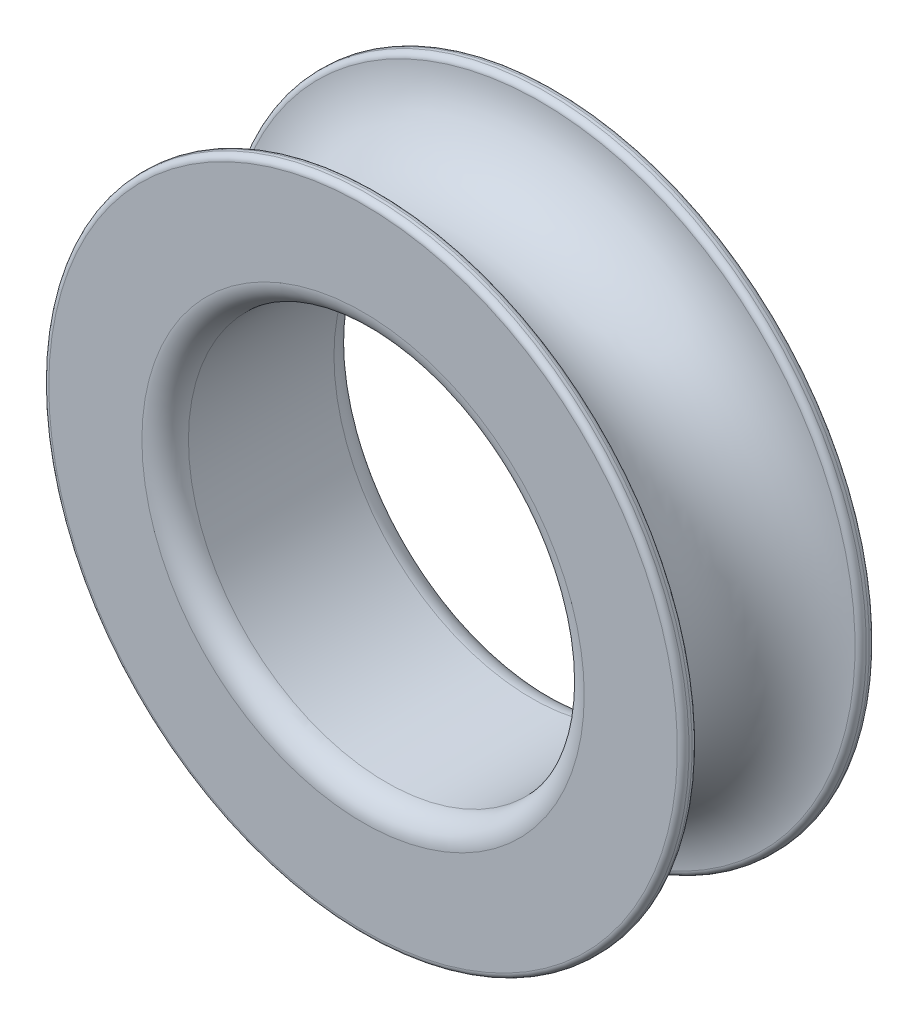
ISO-10303-21;
HEADER;
FILE_DESCRIPTION(('STEP AP214'),'2;1');
FILE_NAME('part.step','',(''),(''),'','','');
FILE_SCHEMA(('AUTOMOTIVE_DESIGN { 1 0 10303 214 1 1 1 1 }'));
ENDSEC;
DATA;
#1=APPLICATION_CONTEXT('core data for automotive mechanical design processes');
#2=APPLICATION_PROTOCOL_DEFINITION('international standard','automotive_design',2000,#1);
#3=PRODUCT_CONTEXT('',#1,'mechanical');
#4=PRODUCT('Part','Part','',(#3));
#5=PRODUCT_RELATED_PRODUCT_CATEGORY('part','',(#4));
#6=PRODUCT_DEFINITION_FORMATION('','',#4);
#7=PRODUCT_DEFINITION_CONTEXT('part definition',#1,'design');
#8=PRODUCT_DEFINITION('design','',#6,#7);
#9=PRODUCT_DEFINITION_SHAPE('','',#8);
#10=(LENGTH_UNIT() NAMED_UNIT(*) SI_UNIT(.MILLI.,.METRE.));
#11=(NAMED_UNIT(*) PLANE_ANGLE_UNIT() SI_UNIT($,.RADIAN.));
#12=(NAMED_UNIT(*) SI_UNIT($,.STERADIAN.) SOLID_ANGLE_UNIT());
#13=UNCERTAINTY_MEASURE_WITH_UNIT(LENGTH_MEASURE(1.E-05),#10,'distance_accuracy_value','');
#14=(GEOMETRIC_REPRESENTATION_CONTEXT(3) GLOBAL_UNCERTAINTY_ASSIGNED_CONTEXT((#13)) GLOBAL_UNIT_ASSIGNED_CONTEXT((#10,
#11,#12)) REPRESENTATION_CONTEXT('',''));
#15=CARTESIAN_POINT('',(0.,0.,0.));
#16=DIRECTION('',(0.,0.,1.));
#17=DIRECTION('',(1.,0.,0.));
#18=AXIS2_PLACEMENT_3D('',#15,#16,#17);
#19=CARTESIAN_POINT('',(0.,0.,-7.75000000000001));
#20=DIRECTION('',(0.,0.,-1.));
#21=DIRECTION('',(-1.,0.,0.));
#22=AXIS2_PLACEMENT_3D('',#19,#20,#21);
#23=TOROIDAL_SURFACE('',#22,27.,0.499999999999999);
#24=CARTESIAN_POINT('',(0.,0.,-7.75000000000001));
#25=DIRECTION('',(0.,0.,-1.));
#26=DIRECTION('',(-1.,0.,0.));
#27=AXIS2_PLACEMENT_3D('',#24,#25,#26);
#28=CIRCLE('',#27,27.5);
#29=CARTESIAN_POINT('',(-27.5,0.,-7.75000000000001));
#30=VERTEX_POINT('',#29);
#31=EDGE_CURVE('E10',#30,#30,#28,.T.);
#32=ORIENTED_EDGE('',*,*,#31,.T.);
#33=EDGE_LOOP('',(#32));
#34=FACE_BOUND('',#33,.T.);
#35=CARTESIAN_POINT('',(0.,0.,-8.25));
#36=DIRECTION('',(0.,0.,-1.));
#37=DIRECTION('',(-1.,0.,0.));
#38=AXIS2_PLACEMENT_3D('',#35,#36,#37);
#39=CIRCLE('',#38,27.);
#40=CARTESIAN_POINT('',(-27.,0.,-8.25000000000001));
#41=VERTEX_POINT('',#40);
#42=EDGE_CURVE('E79',#41,#41,#39,.T.);
#43=ORIENTED_EDGE('',*,*,#42,.F.);
#44=EDGE_LOOP('',(#43));
#45=FACE_BOUND('',#44,.T.);
#46=ADVANCED_FACE('F38',(#34,#45),#23,.T.);
#47=CARTESIAN_POINT('',(0.,0.,8.84));
#48=DIRECTION('',(0.,0.,-1.));
#49=DIRECTION('',(-1.,0.,0.));
#50=AXIS2_PLACEMENT_3D('',#47,#48,#49);
#51=CYLINDRICAL_SURFACE('',#50,27.5);
#52=CARTESIAN_POINT('',(0.,0.,-7.4833147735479));
#53=DIRECTION('',(0.,0.,-1.));
#54=DIRECTION('',(-1.,0.,0.));
#55=AXIS2_PLACEMENT_3D('',#52,#53,#54);
#56=CIRCLE('',#55,27.5);
#57=CARTESIAN_POINT('',(-27.5,0.,-7.4833147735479));
#58=VERTEX_POINT('',#57);
#59=EDGE_CURVE('E45',#58,#58,#56,.T.);
#60=ORIENTED_EDGE('',*,*,#59,.T.);
#61=EDGE_LOOP('',(#60));
#62=FACE_BOUND('',#61,.T.);
#63=ORIENTED_EDGE('',*,*,#31,.F.);
#64=EDGE_LOOP('',(#63));
#65=FACE_BOUND('',#64,.T.);
#66=ADVANCED_FACE('F85',(#62,#65),#51,.T.);
#67=CARTESIAN_POINT('',(0.,0.,-7.4833147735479));
#68=DIRECTION('',(0.,0.,-1.));
#69=DIRECTION('',(-1.,0.,0.));
#70=AXIS2_PLACEMENT_3D('',#67,#68,#69);
#71=TOROIDAL_SURFACE('',#70,27.,0.500000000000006);
#72=CARTESIAN_POINT('',(0.,0.,-6.98442712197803));
#73=DIRECTION('',(0.,0.,-1.));
#74=DIRECTION('',(-1.,0.,0.));
#75=AXIS2_PLACEMENT_3D('',#72,#73,#74);
#76=CIRCLE('',#75,27.0333333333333);
#77=CARTESIAN_POINT('',(-27.0333333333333,0.,-6.98442712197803));
#78=VERTEX_POINT('',#77);
#79=EDGE_CURVE('E46',#78,#78,#76,.T.);
#80=ORIENTED_EDGE('',*,*,#79,.T.);
#81=EDGE_LOOP('',(#80));
#82=FACE_BOUND('',#81,.T.);
#83=ORIENTED_EDGE('',*,*,#59,.F.);
#84=EDGE_LOOP('',(#83));
#85=FACE_BOUND('',#84,.T.);
#86=ADVANCED_FACE('F86',(#82,#85),#71,.T.);
#87=CARTESIAN_POINT('',(0.,0.,0.));
#88=DIRECTION('',(0.,0.,-1.));
#89=DIRECTION('',(-1.,0.,0.));
#90=AXIS2_PLACEMENT_3D('',#87,#88,#89);
#91=TOROIDAL_SURFACE('',#90,27.4999999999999,7.);
#92=CARTESIAN_POINT('',(0.,0.,6.98442712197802));
#93=DIRECTION('',(0.,0.,-1.));
#94=DIRECTION('',(-1.,0.,0.));
#95=AXIS2_PLACEMENT_3D('',#92,#93,#94);
#96=CIRCLE('',#95,27.0333333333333);
#97=CARTESIAN_POINT('',(-27.0333333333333,0.,6.98442712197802));
#98=VERTEX_POINT('',#97);
#99=EDGE_CURVE('E49',#98,#98,#96,.T.);
#100=ORIENTED_EDGE('',*,*,#99,.T.);
#101=EDGE_LOOP('',(#100));
#102=FACE_BOUND('',#101,.T.);
#103=ORIENTED_EDGE('',*,*,#79,.F.);
#104=EDGE_LOOP('',(#103));
#105=FACE_BOUND('',#104,.T.);
#106=ADVANCED_FACE('F95',(#102,#105),#91,.F.);
#107=CARTESIAN_POINT('',(0.,0.,7.48331477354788));
#108=DIRECTION('',(0.,0.,-1.));
#109=DIRECTION('',(-1.,0.,0.));
#110=AXIS2_PLACEMENT_3D('',#107,#108,#109);
#111=TOROIDAL_SURFACE('',#110,27.,0.499999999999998);
#112=CARTESIAN_POINT('',(0.,0.,7.48331477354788));
#113=DIRECTION('',(0.,0.,-1.));
#114=DIRECTION('',(-1.,0.,0.));
#115=AXIS2_PLACEMENT_3D('',#112,#113,#114);
#116=CIRCLE('',#115,27.5);
#117=CARTESIAN_POINT('',(-27.5,0.,7.48331477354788));
#118=VERTEX_POINT('',#117);
#119=EDGE_CURVE('E54',#118,#118,#116,.T.);
#120=ORIENTED_EDGE('',*,*,#119,.T.);
#121=EDGE_LOOP('',(#120));
#122=FACE_BOUND('',#121,.T.);
#123=ORIENTED_EDGE('',*,*,#99,.F.);
#124=EDGE_LOOP('',(#123));
#125=FACE_BOUND('',#124,.T.);
#126=ADVANCED_FACE('F97',(#122,#125),#111,.T.);
#127=CARTESIAN_POINT('',(0.,0.,8.84));
#128=DIRECTION('',(0.,0.,-1.));
#129=DIRECTION('',(-1.,0.,0.));
#130=AXIS2_PLACEMENT_3D('',#127,#128,#129);
#131=CYLINDRICAL_SURFACE('',#130,27.5);
#132=CARTESIAN_POINT('',(0.,0.,7.75));
#133=DIRECTION('',(0.,0.,-1.));
#134=DIRECTION('',(-1.,0.,0.));
#135=AXIS2_PLACEMENT_3D('',#132,#133,#134);
#136=CIRCLE('',#135,27.5);
#137=CARTESIAN_POINT('',(-27.5,0.,7.74999999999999));
#138=VERTEX_POINT('',#137);
#139=EDGE_CURVE('E59',#138,#138,#136,.T.);
#140=ORIENTED_EDGE('',*,*,#139,.T.);
#141=EDGE_LOOP('',(#140));
#142=FACE_BOUND('',#141,.T.);
#143=ORIENTED_EDGE('',*,*,#119,.F.);
#144=EDGE_LOOP('',(#143));
#145=FACE_BOUND('',#144,.T.);
#146=ADVANCED_FACE('F103',(#142,#145),#131,.T.);
#147=CARTESIAN_POINT('',(0.,0.,7.75));
#148=DIRECTION('',(0.,0.,-1.));
#149=DIRECTION('',(-1.,0.,0.));
#150=AXIS2_PLACEMENT_3D('',#147,#148,#149);
#151=TOROIDAL_SURFACE('',#150,27.,0.499999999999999);
#152=CARTESIAN_POINT('',(0.,0.,8.25));
#153=DIRECTION('',(0.,0.,-1.));
#154=DIRECTION('',(-1.,0.,0.));
#155=AXIS2_PLACEMENT_3D('',#152,#153,#154);
#156=CIRCLE('',#155,27.);
#157=CARTESIAN_POINT('',(-27.,0.,8.24999999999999));
#158=VERTEX_POINT('',#157);
#159=EDGE_CURVE('E64',#158,#158,#156,.T.);
#160=ORIENTED_EDGE('',*,*,#159,.T.);
#161=EDGE_LOOP('',(#160));
#162=FACE_BOUND('',#161,.T.);
#163=ORIENTED_EDGE('',*,*,#139,.F.);
#164=EDGE_LOOP('',(#163));
#165=FACE_BOUND('',#164,.T.);
#166=ADVANCED_FACE('F110',(#162,#165),#151,.T.);
#167=CARTESIAN_POINT('',(27.,0.,8.25));
#168=DIRECTION('',(0.,0.,1.));
#169=DIRECTION('',(1.,0.,0.));
#170=AXIS2_PLACEMENT_3D('',#167,#168,#169);
#171=PLANE('',#170);
#172=CARTESIAN_POINT('',(0.,0.,8.25));
#173=DIRECTION('',(0.,0.,-1.));
#174=DIRECTION('',(-1.,0.,0.));
#175=AXIS2_PLACEMENT_3D('',#172,#173,#174);
#176=CIRCLE('',#175,19.);
#177=CARTESIAN_POINT('',(-19.,0.,8.25));
#178=VERTEX_POINT('',#177);
#179=EDGE_CURVE('E63',#178,#178,#176,.T.);
#180=ORIENTED_EDGE('',*,*,#179,.T.);
#181=EDGE_LOOP('',(#180));
#182=FACE_BOUND('',#181,.T.);
#183=ORIENTED_EDGE('',*,*,#159,.F.);
#184=EDGE_LOOP('',(#183));
#185=FACE_BOUND('',#184,.T.);
#186=ADVANCED_FACE('F112',(#182,#185),#171,.T.);
#187=CARTESIAN_POINT('',(0.,0.,6.25));
#188=DIRECTION('',(0.,0.,-1.));
#189=DIRECTION('',(-1.,0.,0.));
#190=AXIS2_PLACEMENT_3D('',#187,#188,#189);
#191=TOROIDAL_SURFACE('',#190,19.,2.);
#192=CARTESIAN_POINT('',(0.,0.,6.25));
#193=DIRECTION('',(0.,0.,-1.));
#194=DIRECTION('',(-1.,0.,0.));
#195=AXIS2_PLACEMENT_3D('',#192,#193,#194);
#196=CIRCLE('',#195,17.);
#197=CARTESIAN_POINT('',(-17.,0.,6.25));
#198=VERTEX_POINT('',#197);
#199=EDGE_CURVE('E69',#198,#198,#196,.T.);
#200=ORIENTED_EDGE('',*,*,#199,.T.);
#201=EDGE_LOOP('',(#200));
#202=FACE_BOUND('',#201,.T.);
#203=ORIENTED_EDGE('',*,*,#179,.F.);
#204=EDGE_LOOP('',(#203));
#205=FACE_BOUND('',#204,.T.);
#206=ADVANCED_FACE('F113',(#202,#205),#191,.T.);
#207=CARTESIAN_POINT('',(0.,0.,8.84));
#208=DIRECTION('',(0.,0.,-1.));
#209=DIRECTION('',(-1.,0.,0.));
#210=AXIS2_PLACEMENT_3D('',#207,#208,#209);
#211=CYLINDRICAL_SURFACE('',#210,17.);
#212=CARTESIAN_POINT('',(0.,0.,-6.25));
#213=DIRECTION('',(0.,0.,-1.));
#214=DIRECTION('',(-1.,0.,0.));
#215=AXIS2_PLACEMENT_3D('',#212,#213,#214);
#216=CIRCLE('',#215,17.);
#217=CARTESIAN_POINT('',(-17.,0.,-6.25));
#218=VERTEX_POINT('',#217);
#219=EDGE_CURVE('E66',#218,#218,#216,.T.);
#220=ORIENTED_EDGE('',*,*,#219,.T.);
#221=EDGE_LOOP('',(#220));
#222=FACE_BOUND('',#221,.T.);
#223=ORIENTED_EDGE('',*,*,#199,.F.);
#224=EDGE_LOOP('',(#223));
#225=FACE_BOUND('',#224,.T.);
#226=ADVANCED_FACE('F118',(#222,#225),#211,.F.);
#227=CARTESIAN_POINT('',(0.,0.,-6.25));
#228=DIRECTION('',(0.,0.,-1.));
#229=DIRECTION('',(-1.,0.,0.));
#230=AXIS2_PLACEMENT_3D('',#227,#228,#229);
#231=TOROIDAL_SURFACE('',#230,19.,2.);
#232=CARTESIAN_POINT('',(0.,0.,-8.25));
#233=DIRECTION('',(0.,0.,-1.));
#234=DIRECTION('',(-1.,0.,0.));
#235=AXIS2_PLACEMENT_3D('',#232,#233,#234);
#236=CIRCLE('',#235,19.);
#237=CARTESIAN_POINT('',(-19.,0.,-8.25000000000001));
#238=VERTEX_POINT('',#237);
#239=EDGE_CURVE('E71',#238,#238,#236,.T.);
#240=ORIENTED_EDGE('',*,*,#239,.T.);
#241=EDGE_LOOP('',(#240));
#242=FACE_BOUND('',#241,.T.);
#243=ORIENTED_EDGE('',*,*,#219,.F.);
#244=EDGE_LOOP('',(#243));
#245=FACE_BOUND('',#244,.T.);
#246=ADVANCED_FACE('F122',(#242,#245),#231,.T.);
#247=CARTESIAN_POINT('',(19.,0.,-8.25));
#248=DIRECTION('',(0.,0.,-1.));
#249=DIRECTION('',(-1.,0.,0.));
#250=AXIS2_PLACEMENT_3D('',#247,#248,#249);
#251=PLANE('',#250);
#252=ORIENTED_EDGE('',*,*,#42,.T.);
#253=EDGE_LOOP('',(#252));
#254=FACE_BOUND('',#253,.T.);
#255=ORIENTED_EDGE('',*,*,#239,.F.);
#256=EDGE_LOOP('',(#255));
#257=FACE_BOUND('',#256,.T.);
#258=ADVANCED_FACE('F77',(#254,#257),#251,.T.);
#259=CLOSED_SHELL('',(#46,#66,#86,#106,#126,#146,#166,#186,#206,#226,#246,#258));
#260=MANIFOLD_SOLID_BREP('B2',#259);
#261=ADVANCED_BREP_SHAPE_REPRESENTATION('',(#18,#260),#14);
#262=SHAPE_DEFINITION_REPRESENTATION(#9,#261);
ENDSEC;
END-ISO-10303-21;
